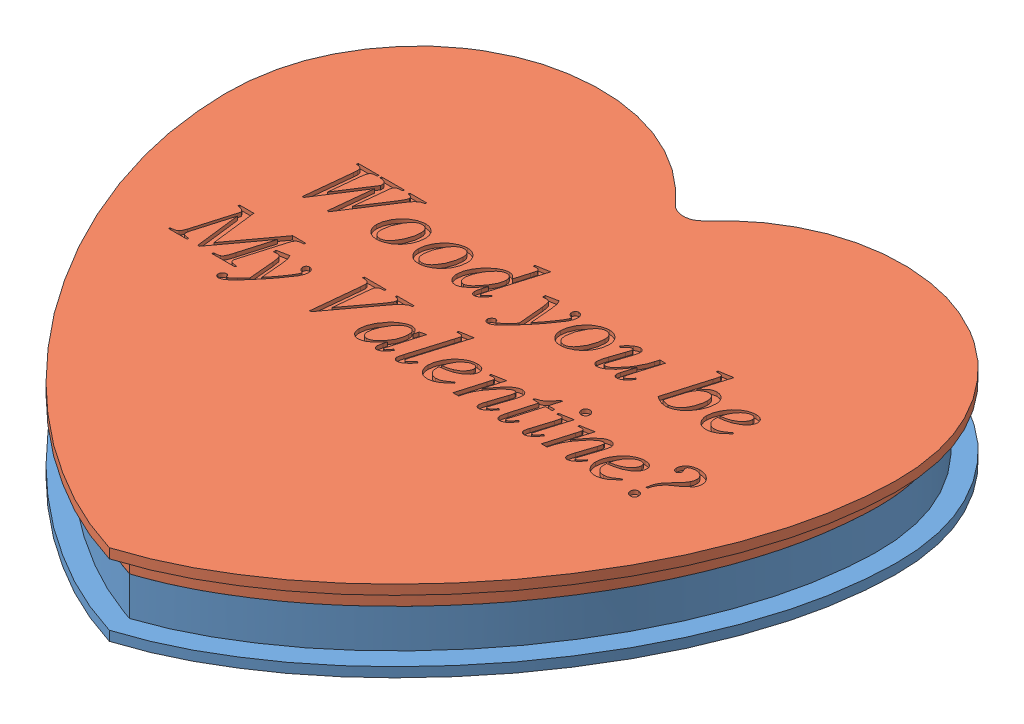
SolidWorks assembly HeartBoxAssembly.SLDASM, configuration Default (file format 7000). Lengths in mm.
Overall size (220.89 26.67 211.37).
2 component instances, 2 part files, 3 mates.
Components (placement in the parent):
- HeartBoxBottom-1: HeartBoxBottom.SLDPRT [Default] at origin size (220.89 15.89 211.37)
- HeartBoxTop-1: HeartBoxTop.SLDPRT [Default] at (0 26.67 0) x (-1 0 0) z (0 0 1) size (220.89 13.33 211.37)
Mates (geometry in assembly coordinates):
- Coincident1: coincident aligned: plane of HeartBoxBottom-1 through (47.5896 3.175 0) normal (-1 0 0); plane of HeartBoxTop-1 through (47.5896 102.1499 0) normal (-1 0 0)
- Coincident2: coincident aligned: plane of HeartBoxBottom-1 through (0 3.175 -52.4159) normal (0 0 -1); plane of HeartBoxTop-1 through (0 102.1499 -52.4159) normal (0 0 -1)
- Coincident3: coincident anti-aligned: plane of HeartBoxBottom-1 through (100.4826 15.875 -121.9283) normal (0 1 0); plane of HeartBoxTop-1 through (-100.4826 15.875 -121.9283) normal (0 -1 0)
